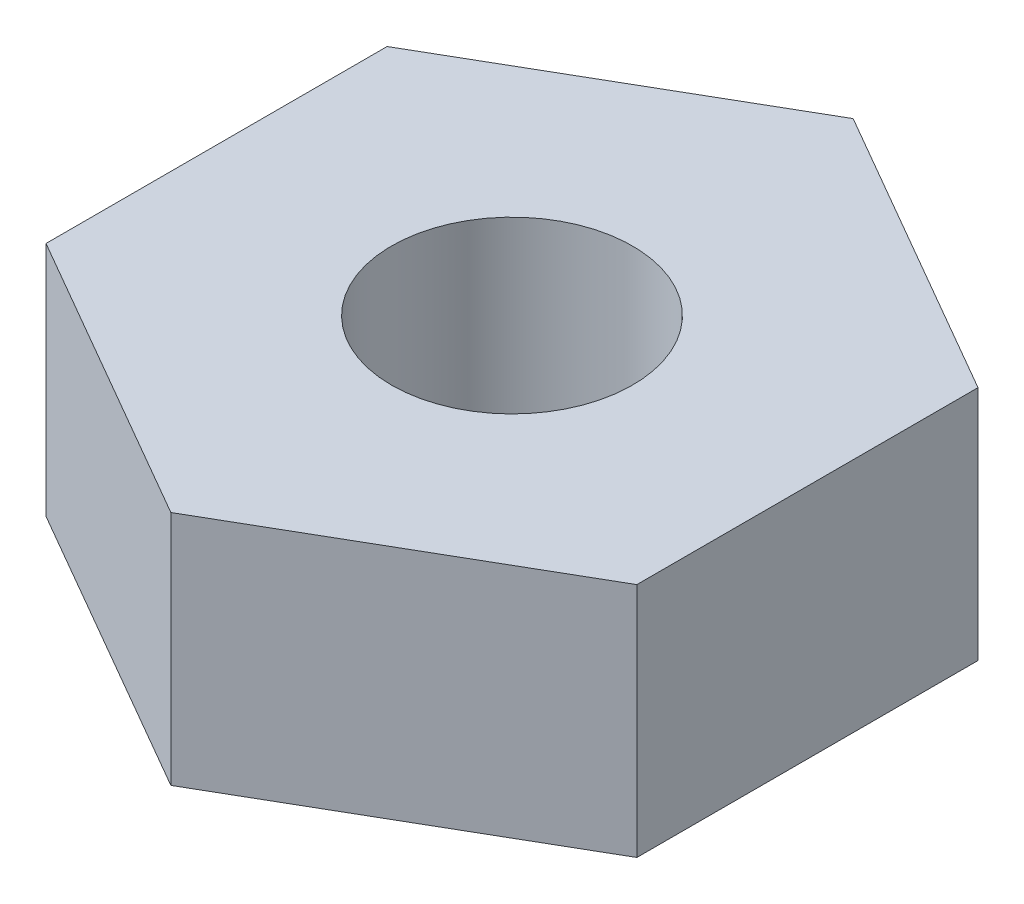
ISO-10303-21;
HEADER;
FILE_DESCRIPTION(('STEP AP214'),'2;1');
FILE_NAME('part.step','',(''),(''),'','','');
FILE_SCHEMA(('AUTOMOTIVE_DESIGN { 1 0 10303 214 1 1 1 1 }'));
ENDSEC;
DATA;
#1=APPLICATION_CONTEXT('core data for automotive mechanical design processes');
#2=APPLICATION_PROTOCOL_DEFINITION('international standard','automotive_design',2000,#1);
#3=PRODUCT_CONTEXT('',#1,'mechanical');
#4=PRODUCT('Part','Part','',(#3));
#5=PRODUCT_RELATED_PRODUCT_CATEGORY('part','',(#4));
#6=PRODUCT_DEFINITION_FORMATION('','',#4);
#7=PRODUCT_DEFINITION_CONTEXT('part definition',#1,'design');
#8=PRODUCT_DEFINITION('design','',#6,#7);
#9=PRODUCT_DEFINITION_SHAPE('','',#8);
#10=(LENGTH_UNIT() NAMED_UNIT(*) SI_UNIT(.MILLI.,.METRE.));
#11=(NAMED_UNIT(*) PLANE_ANGLE_UNIT() SI_UNIT($,.RADIAN.));
#12=(NAMED_UNIT(*) SI_UNIT($,.STERADIAN.) SOLID_ANGLE_UNIT());
#13=UNCERTAINTY_MEASURE_WITH_UNIT(LENGTH_MEASURE(1.E-05),#10,'distance_accuracy_value','');
#14=(GEOMETRIC_REPRESENTATION_CONTEXT(3) GLOBAL_UNCERTAINTY_ASSIGNED_CONTEXT((#13)) GLOBAL_UNIT_ASSIGNED_CONTEXT((#10,
#11,#12)) REPRESENTATION_CONTEXT('',''));
#15=CARTESIAN_POINT('',(0.,0.,0.));
#16=DIRECTION('',(0.,0.,1.));
#17=DIRECTION('',(1.,0.,0.));
#18=AXIS2_PLACEMENT_3D('',#15,#16,#17);
#19=CARTESIAN_POINT('',(0.,0.,0.));
#20=DIRECTION('',(0.,-1.,0.));
#21=DIRECTION('',(0.,0.,-1.));
#22=AXIS2_PLACEMENT_3D('',#19,#20,#21);
#23=PLANE('',#22);
#24=CARTESIAN_POINT('',(0.,0.,0.));
#25=DIRECTION('',(0.,1.,0.));
#26=DIRECTION('',(0.,0.,1.));
#27=AXIS2_PLACEMENT_3D('',#24,#25,#26);
#28=CIRCLE('',#27,1.02);
#29=CARTESIAN_POINT('',(0.,0.,1.02));
#30=VERTEX_POINT('',#29);
#31=EDGE_CURVE('E18',#30,#30,#28,.F.);
#32=ORIENTED_EDGE('',*,*,#31,.T.);
#33=EDGE_LOOP('',(#32));
#34=FACE_BOUND('',#33,.T.);
#35=DIRECTION('',(-0.866025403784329,0.,-0.50000000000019));
#36=VECTOR('',#35,1.);
#37=CARTESIAN_POINT('',(0.,0.,-2.886751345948));
#38=LINE('',#37,#36);
#39=CARTESIAN_POINT('',(-1.72438789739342E-13,0.,-2.8867513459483));
#40=VERTEX_POINT('',#39);
#41=CARTESIAN_POINT('',(2.49999999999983,0.,-1.4433756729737));
#42=VERTEX_POINT('',#41);
#43=EDGE_CURVE('E101',#40,#42,#38,.F.);
#44=ORIENTED_EDGE('',*,*,#43,.F.);
#45=DIRECTION('',(-0.866025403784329,0.,0.50000000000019));
#46=VECTOR('',#45,1.);
#47=CARTESIAN_POINT('',(-2.5,0.,-1.443375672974));
#48=LINE('',#47,#46);
#49=CARTESIAN_POINT('',(-2.5,0.,-1.443375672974));
#50=VERTEX_POINT('',#49);
#51=EDGE_CURVE('E96',#50,#40,#48,.F.);
#52=ORIENTED_EDGE('',*,*,#51,.F.);
#53=DIRECTION('',(0.,0.,1.));
#54=VECTOR('',#53,1.);
#55=CARTESIAN_POINT('',(-2.5,0.,1.443375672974));
#56=LINE('',#55,#54);
#57=CARTESIAN_POINT('',(-2.49999999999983,0.,1.4433756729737));
#58=VERTEX_POINT('',#57);
#59=EDGE_CURVE('E81',#58,#50,#56,.F.);
#60=ORIENTED_EDGE('',*,*,#59,.F.);
#61=DIRECTION('',(0.866025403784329,0.,0.50000000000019));
#62=VECTOR('',#61,1.);
#63=CARTESIAN_POINT('',(0.,0.,2.886751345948));
#64=LINE('',#63,#62);
#65=CARTESIAN_POINT('',(1.71983363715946E-13,0.,2.8867513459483));
#66=VERTEX_POINT('',#65);
#67=EDGE_CURVE('E64',#66,#58,#64,.F.);
#68=ORIENTED_EDGE('',*,*,#67,.F.);
#69=DIRECTION('',(0.866025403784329,0.,-0.50000000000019));
#70=VECTOR('',#69,1.);
#71=CARTESIAN_POINT('',(2.5,0.,1.443375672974));
#72=LINE('',#71,#70);
#73=CARTESIAN_POINT('',(2.5,0.,1.443375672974));
#74=VERTEX_POINT('',#73);
#75=EDGE_CURVE('E69',#74,#66,#72,.F.);
#76=ORIENTED_EDGE('',*,*,#75,.F.);
#77=DIRECTION('',(0.,0.,-1.));
#78=VECTOR('',#77,1.);
#79=CARTESIAN_POINT('',(2.5,0.,-1.443375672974));
#80=LINE('',#79,#78);
#81=EDGE_CURVE('E104',#42,#74,#80,.F.);
#82=ORIENTED_EDGE('',*,*,#81,.F.);
#83=EDGE_LOOP('',(#44,#52,#60,#68,#76,#82));
#84=FACE_BOUND('',#83,.T.);
#85=ADVANCED_FACE('F15',(#34,#84),#23,.F.);
#86=CARTESIAN_POINT('',(2.5,-2.,1.443375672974));
#87=DIRECTION('',(0.50000000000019,0.,0.866025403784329));
#88=DIRECTION('',(0.866025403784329,0.,-0.50000000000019));
#89=AXIS2_PLACEMENT_3D('',#86,#87,#88);
#90=PLANE('',#89);
#91=DIRECTION('',(0.,1.,0.));
#92=VECTOR('',#91,1.);
#93=CARTESIAN_POINT('',(0.,-2.,2.886751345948));
#94=LINE('',#93,#92);
#95=CARTESIAN_POINT('',(1.71983363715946E-13,-2.,2.8867513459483));
#96=VERTEX_POINT('',#95);
#97=EDGE_CURVE('E71',#96,#66,#94,.T.);
#98=ORIENTED_EDGE('',*,*,#97,.F.);
#99=DIRECTION('',(-0.866025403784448,0.,0.499999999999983));
#100=VECTOR('',#99,1.);
#101=CARTESIAN_POINT('',(2.5,-2.,1.443375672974));
#102=LINE('',#101,#100);
#103=CARTESIAN_POINT('',(2.5,-2.,1.443375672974));
#104=VERTEX_POINT('',#103);
#105=EDGE_CURVE('E107',#104,#96,#102,.T.);
#106=ORIENTED_EDGE('',*,*,#105,.F.);
#107=DIRECTION('',(0.,1.,0.));
#108=VECTOR('',#107,1.);
#109=CARTESIAN_POINT('',(2.5,-2.,1.443375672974));
#110=LINE('',#109,#108);
#111=EDGE_CURVE('E74',#74,#104,#110,.F.);
#112=ORIENTED_EDGE('',*,*,#111,.F.);
#113=ORIENTED_EDGE('',*,*,#75,.T.);
#114=EDGE_LOOP('',(#98,#106,#112,#113));
#115=FACE_BOUND('',#114,.T.);
#116=ADVANCED_FACE('F70',(#115),#90,.T.);
#117=CARTESIAN_POINT('',(0.,-2.,2.886751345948));
#118=DIRECTION('',(-0.50000000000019,0.,0.866025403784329));
#119=DIRECTION('',(0.866025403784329,0.,0.50000000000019));
#120=AXIS2_PLACEMENT_3D('',#117,#118,#119);
#121=PLANE('',#120);
#122=DIRECTION('',(0.,1.,0.));
#123=VECTOR('',#122,1.);
#124=CARTESIAN_POINT('',(-2.5,-2.,1.443375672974));
#125=LINE('',#124,#123);
#126=CARTESIAN_POINT('',(-2.49999999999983,-2.,1.4433756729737));
#127=VERTEX_POINT('',#126);
#128=EDGE_CURVE('E83',#127,#58,#125,.T.);
#129=ORIENTED_EDGE('',*,*,#128,.F.);
#130=DIRECTION('',(-0.866025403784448,0.,-0.499999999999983));
#131=VECTOR('',#130,1.);
#132=CARTESIAN_POINT('',(0.,-2.,2.886751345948));
#133=LINE('',#132,#131);
#134=EDGE_CURVE('E87',#96,#127,#133,.T.);
#135=ORIENTED_EDGE('',*,*,#134,.F.);
#136=ORIENTED_EDGE('',*,*,#97,.T.);
#137=ORIENTED_EDGE('',*,*,#67,.T.);
#138=EDGE_LOOP('',(#129,#135,#136,#137));
#139=FACE_BOUND('',#138,.T.);
#140=ADVANCED_FACE('F85',(#139),#121,.T.);
#141=CARTESIAN_POINT('',(-2.5,-2.,1.443375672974));
#142=DIRECTION('',(-1.,0.,0.));
#143=DIRECTION('',(0.,0.,1.));
#144=AXIS2_PLACEMENT_3D('',#141,#142,#143);
#145=PLANE('',#144);
#146=DIRECTION('',(0.,1.,0.));
#147=VECTOR('',#146,1.);
#148=CARTESIAN_POINT('',(-2.5,-2.,-1.443375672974));
#149=LINE('',#148,#147);
#150=CARTESIAN_POINT('',(-2.5,-2.,-1.443375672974));
#151=VERTEX_POINT('',#150);
#152=EDGE_CURVE('E93',#151,#50,#149,.T.);
#153=ORIENTED_EDGE('',*,*,#152,.F.);
#154=DIRECTION('',(0.,0.,-1.));
#155=VECTOR('',#154,1.);
#156=CARTESIAN_POINT('',(-2.5,-2.,0.));
#157=LINE('',#156,#155);
#158=EDGE_CURVE('E110',#127,#151,#157,.T.);
#159=ORIENTED_EDGE('',*,*,#158,.F.);
#160=ORIENTED_EDGE('',*,*,#128,.T.);
#161=ORIENTED_EDGE('',*,*,#59,.T.);
#162=EDGE_LOOP('',(#153,#159,#160,#161));
#163=FACE_BOUND('',#162,.T.);
#164=ADVANCED_FACE('F130',(#163),#145,.T.);
#165=CARTESIAN_POINT('',(-2.5,-2.,-1.443375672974));
#166=DIRECTION('',(-0.50000000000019,0.,-0.866025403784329));
#167=DIRECTION('',(-0.866025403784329,0.,0.50000000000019));
#168=AXIS2_PLACEMENT_3D('',#165,#166,#167);
#169=PLANE('',#168);
#170=DIRECTION('',(0.,1.,0.));
#171=VECTOR('',#170,1.);
#172=CARTESIAN_POINT('',(0.,-2.,-2.886751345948));
#173=LINE('',#172,#171);
#174=CARTESIAN_POINT('',(-1.72438789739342E-13,-2.,-2.8867513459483));
#175=VERTEX_POINT('',#174);
#176=EDGE_CURVE('E98',#175,#40,#173,.T.);
#177=ORIENTED_EDGE('',*,*,#176,.F.);
#178=DIRECTION('',(0.866025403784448,0.,-0.499999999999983));
#179=VECTOR('',#178,1.);
#180=CARTESIAN_POINT('',(-2.5,-2.,-1.443375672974));
#181=LINE('',#180,#179);
#182=EDGE_CURVE('E113',#151,#175,#181,.T.);
#183=ORIENTED_EDGE('',*,*,#182,.F.);
#184=ORIENTED_EDGE('',*,*,#152,.T.);
#185=ORIENTED_EDGE('',*,*,#51,.T.);
#186=EDGE_LOOP('',(#177,#183,#184,#185));
#187=FACE_BOUND('',#186,.T.);
#188=ADVANCED_FACE('F127',(#187),#169,.T.);
#189=CARTESIAN_POINT('',(0.,-2.,-2.886751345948));
#190=DIRECTION('',(0.50000000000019,0.,-0.866025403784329));
#191=DIRECTION('',(-0.866025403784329,0.,-0.50000000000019));
#192=AXIS2_PLACEMENT_3D('',#189,#190,#191);
#193=PLANE('',#192);
#194=DIRECTION('',(0.,1.,0.));
#195=VECTOR('',#194,1.);
#196=CARTESIAN_POINT('',(2.5,-2.,-1.443375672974));
#197=LINE('',#196,#195);
#198=CARTESIAN_POINT('',(2.49999999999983,-2.,-1.4433756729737));
#199=VERTEX_POINT('',#198);
#200=EDGE_CURVE('E32',#199,#42,#197,.T.);
#201=ORIENTED_EDGE('',*,*,#200,.F.);
#202=DIRECTION('',(0.866025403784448,0.,0.499999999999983));
#203=VECTOR('',#202,1.);
#204=CARTESIAN_POINT('',(0.,-2.,-2.886751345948));
#205=LINE('',#204,#203);
#206=EDGE_CURVE('E116',#175,#199,#205,.T.);
#207=ORIENTED_EDGE('',*,*,#206,.F.);
#208=ORIENTED_EDGE('',*,*,#176,.T.);
#209=ORIENTED_EDGE('',*,*,#43,.T.);
#210=EDGE_LOOP('',(#201,#207,#208,#209));
#211=FACE_BOUND('',#210,.T.);
#212=ADVANCED_FACE('F124',(#211),#193,.T.);
#213=CARTESIAN_POINT('',(2.5,-2.,-1.443375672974));
#214=DIRECTION('',(1.,0.,0.));
#215=DIRECTION('',(0.,0.,-1.));
#216=AXIS2_PLACEMENT_3D('',#213,#214,#215);
#217=PLANE('',#216);
#218=ORIENTED_EDGE('',*,*,#111,.T.);
#219=DIRECTION('',(0.,0.,-1.));
#220=VECTOR('',#219,1.);
#221=CARTESIAN_POINT('',(2.5,-2.,0.));
#222=LINE('',#221,#220);
#223=EDGE_CURVE('E24',#199,#104,#222,.F.);
#224=ORIENTED_EDGE('',*,*,#223,.F.);
#225=ORIENTED_EDGE('',*,*,#200,.T.);
#226=ORIENTED_EDGE('',*,*,#81,.T.);
#227=EDGE_LOOP('',(#218,#224,#225,#226));
#228=FACE_BOUND('',#227,.T.);
#229=ADVANCED_FACE('F123',(#228),#217,.T.);
#230=CARTESIAN_POINT('',(0.,-2.1,0.));
#231=DIRECTION('',(0.,1.,0.));
#232=DIRECTION('',(0.,0.,1.));
#233=AXIS2_PLACEMENT_3D('',#230,#231,#232);
#234=CYLINDRICAL_SURFACE('',#233,1.02);
#235=CARTESIAN_POINT('',(0.,-2.,0.));
#236=DIRECTION('',(0.,1.,0.));
#237=DIRECTION('',(0.,0.,1.));
#238=AXIS2_PLACEMENT_3D('',#235,#236,#237);
#239=CIRCLE('',#238,1.02);
#240=CARTESIAN_POINT('',(0.,-2.,1.02));
#241=VERTEX_POINT('',#240);
#242=EDGE_CURVE('E9',#241,#241,#239,.T.);
#243=ORIENTED_EDGE('',*,*,#242,.F.);
#244=EDGE_LOOP('',(#243));
#245=FACE_BOUND('',#244,.T.);
#246=ORIENTED_EDGE('',*,*,#31,.F.);
#247=EDGE_LOOP('',(#246));
#248=FACE_BOUND('',#247,.T.);
#249=ADVANCED_FACE('F141',(#245,#248),#234,.F.);
#250=CARTESIAN_POINT('',(0.,-2.,0.));
#251=DIRECTION('',(0.,-1.,0.));
#252=DIRECTION('',(0.,0.,-1.));
#253=AXIS2_PLACEMENT_3D('',#250,#251,#252);
#254=PLANE('',#253);
#255=ORIENTED_EDGE('',*,*,#242,.T.);
#256=EDGE_LOOP('',(#255));
#257=FACE_BOUND('',#256,.T.);
#258=ORIENTED_EDGE('',*,*,#206,.T.);
#259=ORIENTED_EDGE('',*,*,#223,.T.);
#260=ORIENTED_EDGE('',*,*,#105,.T.);
#261=ORIENTED_EDGE('',*,*,#134,.T.);
#262=ORIENTED_EDGE('',*,*,#158,.T.);
#263=ORIENTED_EDGE('',*,*,#182,.T.);
#264=EDGE_LOOP('',(#258,#259,#260,#261,#262,#263));
#265=FACE_BOUND('',#264,.T.);
#266=ADVANCED_FACE('F121',(#257,#265),#254,.T.);
#267=CLOSED_SHELL('',(#85,#116,#140,#164,#188,#212,#229,#249,#266));
#268=MANIFOLD_SOLID_BREP('B1',#267);
#269=ADVANCED_BREP_SHAPE_REPRESENTATION('',(#18,#268),#14);
#270=SHAPE_DEFINITION_REPRESENTATION(#9,#269);
ENDSEC;
END-ISO-10303-21;
